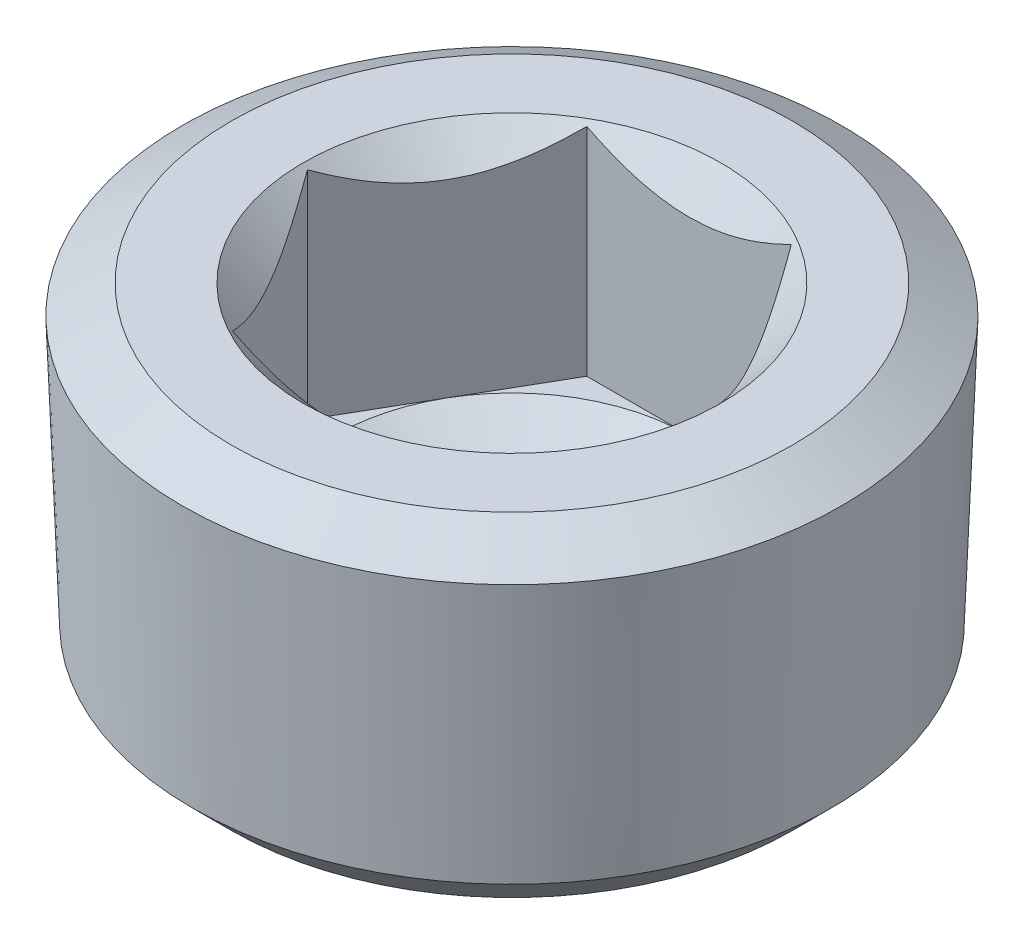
ISO-10303-21;
HEADER;
FILE_DESCRIPTION(('STEP AP214'),'2;1');
FILE_NAME('part.step','',(''),(''),'','','');
FILE_SCHEMA(('AUTOMOTIVE_DESIGN { 1 0 10303 214 1 1 1 1 }'));
ENDSEC;
DATA;
#1=APPLICATION_CONTEXT('core data for automotive mechanical design processes');
#2=APPLICATION_PROTOCOL_DEFINITION('international standard','automotive_design',2000,#1);
#3=PRODUCT_CONTEXT('',#1,'mechanical');
#4=PRODUCT('Part','Part','',(#3));
#5=PRODUCT_RELATED_PRODUCT_CATEGORY('part','',(#4));
#6=PRODUCT_DEFINITION_FORMATION('','',#4);
#7=PRODUCT_DEFINITION_CONTEXT('part definition',#1,'design');
#8=PRODUCT_DEFINITION('design','',#6,#7);
#9=PRODUCT_DEFINITION_SHAPE('','',#8);
#10=(LENGTH_UNIT() NAMED_UNIT(*) SI_UNIT(.MILLI.,.METRE.));
#11=(NAMED_UNIT(*) PLANE_ANGLE_UNIT() SI_UNIT($,.RADIAN.));
#12=(NAMED_UNIT(*) SI_UNIT($,.STERADIAN.) SOLID_ANGLE_UNIT());
#13=UNCERTAINTY_MEASURE_WITH_UNIT(LENGTH_MEASURE(1.E-05),#10,'distance_accuracy_value','');
#14=(GEOMETRIC_REPRESENTATION_CONTEXT(3) GLOBAL_UNCERTAINTY_ASSIGNED_CONTEXT((#13)) GLOBAL_UNIT_ASSIGNED_CONTEXT((#10,
#11,#12)) REPRESENTATION_CONTEXT('',''));
#15=CARTESIAN_POINT('',(0.,0.,0.));
#16=DIRECTION('',(0.,0.,1.));
#17=DIRECTION('',(1.,0.,0.));
#18=AXIS2_PLACEMENT_3D('',#15,#16,#17);
#19=CARTESIAN_POINT('',(0.,0.,0.));
#20=DIRECTION('',(0.,1.,0.));
#21=DIRECTION('',(0.,0.,1.));
#22=AXIS2_PLACEMENT_3D('',#19,#20,#21);
#23=PLANE('',#22);
#24=CARTESIAN_POINT('',(0.,0.,0.));
#25=DIRECTION('',(0.,1.,0.));
#26=DIRECTION('',(0.,0.,1.));
#27=AXIS2_PLACEMENT_3D('',#24,#25,#26);
#28=CIRCLE('',#27,8.41375);
#29=CARTESIAN_POINT('',(0.,0.,8.41375));
#30=VERTEX_POINT('',#29);
#31=EDGE_CURVE('E238',#30,#30,#28,.T.);
#32=ORIENTED_EDGE('',*,*,#31,.F.);
#33=EDGE_LOOP('',(#32));
#34=FACE_BOUND('',#33,.T.);
#35=CARTESIAN_POINT('',(0.,0.,0.));
#36=DIRECTION('',(0.,1.,0.));
#37=DIRECTION('',(0.,0.,1.));
#38=AXIS2_PLACEMENT_3D('',#35,#36,#37);
#39=CIRCLE('',#38,11.3201941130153);
#40=CARTESIAN_POINT('',(0.,0.,11.3201941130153));
#41=VERTEX_POINT('',#40);
#42=EDGE_CURVE('E12',#41,#41,#39,.T.);
#43=ORIENTED_EDGE('',*,*,#42,.T.);
#44=EDGE_LOOP('',(#43));
#45=FACE_BOUND('',#44,.T.);
#46=ADVANCED_FACE('F33',(#34,#45),#23,.T.);
#47=CARTESIAN_POINT('',(0.,0.,0.));
#48=DIRECTION('',(0.,-1.,0.));
#49=DIRECTION('',(0.,0.,-1.));
#50=AXIS2_PLACEMENT_3D('',#47,#48,#49);
#51=CONICAL_SURFACE('',#50,11.3201941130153,1.0471975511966);
#52=CARTESIAN_POINT('',(0.,-1.13926782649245,0.));
#53=DIRECTION('',(0.,1.,0.));
#54=DIRECTION('',(0.,0.,1.));
#55=AXIS2_PLACEMENT_3D('',#52,#53,#54);
#56=CIRCLE('',#55,13.2934638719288);
#57=CARTESIAN_POINT('',(0.,-1.13926782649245,13.2934638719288));
#58=VERTEX_POINT('',#57);
#59=EDGE_CURVE('E40',#58,#58,#56,.T.);
#60=ORIENTED_EDGE('',*,*,#59,.T.);
#61=EDGE_LOOP('',(#60));
#62=FACE_BOUND('',#61,.T.);
#63=ORIENTED_EDGE('',*,*,#42,.F.);
#64=EDGE_LOOP('',(#63));
#65=FACE_BOUND('',#64,.T.);
#66=ADVANCED_FACE('F228',(#62,#65),#51,.T.);
#67=CARTESIAN_POINT('',(0.,-1.13926782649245,0.));
#68=DIRECTION('',(0.,1.,0.));
#69=DIRECTION('',(0.,0.,1.));
#70=AXIS2_PLACEMENT_3D('',#67,#68,#69);
#71=CONICAL_SURFACE('',#70,13.2934638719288,0.0364424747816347);
#72=CARTESIAN_POINT('',(0.,-11.8803346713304,0.));
#73=DIRECTION('',(0.,1.,0.));
#74=DIRECTION('',(0.,0.,1.));
#75=AXIS2_PLACEMENT_3D('',#72,#73,#74);
#76=CIRCLE('',#75,12.9018594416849);
#77=CARTESIAN_POINT('',(0.,-11.8803346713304,12.9018594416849));
#78=VERTEX_POINT('',#77);
#79=EDGE_CURVE('E246',#78,#78,#76,.T.);
#80=ORIENTED_EDGE('',*,*,#79,.T.);
#81=EDGE_LOOP('',(#80));
#82=FACE_BOUND('',#81,.T.);
#83=ORIENTED_EDGE('',*,*,#59,.F.);
#84=EDGE_LOOP('',(#83));
#85=FACE_BOUND('',#84,.T.);
#86=ADVANCED_FACE('F233',(#82,#85),#71,.T.);
#87=CARTESIAN_POINT('',(0.,-11.8803346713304,0.));
#88=DIRECTION('',(0.,1.,0.));
#89=DIRECTION('',(0.,0.,1.));
#90=AXIS2_PLACEMENT_3D('',#87,#88,#89);
#91=CONICAL_SURFACE('',#90,12.9018594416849,0.785398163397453);
#92=CARTESIAN_POINT('',(0.,-13.462,0.));
#93=DIRECTION('',(0.,1.,0.));
#94=DIRECTION('',(0.,0.,1.));
#95=AXIS2_PLACEMENT_3D('',#92,#93,#94);
#96=CIRCLE('',#95,11.3201941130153);
#97=CARTESIAN_POINT('',(0.,-13.462,11.3201941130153));
#98=VERTEX_POINT('',#97);
#99=EDGE_CURVE('E242',#98,#98,#96,.T.);
#100=ORIENTED_EDGE('',*,*,#99,.T.);
#101=EDGE_LOOP('',(#100));
#102=FACE_BOUND('',#101,.T.);
#103=ORIENTED_EDGE('',*,*,#79,.F.);
#104=EDGE_LOOP('',(#103));
#105=FACE_BOUND('',#104,.T.);
#106=ADVANCED_FACE('F257',(#102,#105),#91,.T.);
#107=CARTESIAN_POINT('',(-11.3201941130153,-13.462,0.));
#108=DIRECTION('',(0.,-1.,0.));
#109=DIRECTION('',(0.,0.,-1.));
#110=AXIS2_PLACEMENT_3D('',#107,#108,#109);
#111=PLANE('',#110);
#112=ORIENTED_EDGE('',*,*,#99,.F.);
#113=EDGE_LOOP('',(#112));
#114=FACE_BOUND('',#113,.T.);
#115=ADVANCED_FACE('F175',(#114),#111,.T.);
#116=CARTESIAN_POINT('',(0.,0.,0.));
#117=DIRECTION('',(0.,1.,0.));
#118=DIRECTION('',(0.,0.,1.));
#119=AXIS2_PLACEMENT_3D('',#116,#117,#118);
#120=CONICAL_SURFACE('',#119,8.41375,0.785398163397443);
#121=CARTESIAN_POINT('',(-8.67407425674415,2.82336387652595,7.14375));
#122=CARTESIAN_POINT('',(-8.46476721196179,2.66183323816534,7.14375));
#123=CARTESIAN_POINT('',(-8.25433999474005,2.50173141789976,7.14375));
#124=CARTESIAN_POINT('',(-7.8307846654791,2.18504039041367,7.14375));
#125=CARTESIAN_POINT('',(-7.61765593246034,2.02845201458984,7.14375));
#126=CARTESIAN_POINT('',(-7.18668039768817,1.71832876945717,7.14375));
#127=CARTESIAN_POINT('',(-6.96880989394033,1.56482673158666,7.14375));
#128=CARTESIAN_POINT('',(-6.5294560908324,1.26310103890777,7.14375));
#129=CARTESIAN_POINT('',(-6.30797304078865,1.11487702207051,7.14375));
#130=CARTESIAN_POINT('',(-5.84635573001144,0.815561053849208,7.14375));
#131=CARTESIAN_POINT('',(-5.60594002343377,0.664900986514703,7.14375));
#132=CARTESIAN_POINT('',(-5.11945866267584,0.372839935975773,7.14375));
#133=CARTESIAN_POINT('',(-4.87339205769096,0.231440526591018,7.14375));
#134=CARTESIAN_POINT('',(-4.37552614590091,-0.0390949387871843,7.14375));
#135=CARTESIAN_POINT('',(-4.12374654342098,-0.168266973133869,7.14375));
#136=CARTESIAN_POINT('',(-3.61302840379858,-0.411453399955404,7.14375));
#137=CARTESIAN_POINT('',(-3.35409333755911,-0.525474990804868,7.14375));
#138=CARTESIAN_POINT('',(-2.85518097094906,-0.723606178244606,7.14375));
#139=CARTESIAN_POINT('',(-2.61595074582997,-0.809577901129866,7.14375));
#140=CARTESIAN_POINT('',(-2.13133843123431,-0.962377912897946,7.14375));
#141=CARTESIAN_POINT('',(-1.88595595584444,-1.02920499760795,7.14375));
#142=CARTESIAN_POINT('',(-1.39481286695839,-1.13896092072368,7.14375));
#143=CARTESIAN_POINT('',(-1.14915190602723,-1.1823281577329,7.14375));
#144=CARTESIAN_POINT('',(-0.654704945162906,-1.24424979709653,7.14375));
#145=CARTESIAN_POINT('',(-0.405919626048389,-1.26280951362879,7.14375));
#146=CARTESIAN_POINT('',(0.0809931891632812,-1.2735005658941,7.14375));
#147=CARTESIAN_POINT('',(0.319095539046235,-1.26678561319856,7.14375));
#148=CARTESIAN_POINT('',(0.793471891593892,-1.22996205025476,7.14375));
#149=CARTESIAN_POINT('',(1.02974572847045,-1.19985134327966,7.14375));
#150=CARTESIAN_POINT('',(1.50276174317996,-1.11743740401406,7.14375));
#151=CARTESIAN_POINT('',(1.73943403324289,-1.06473985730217,7.14375));
#152=CARTESIAN_POINT('',(2.20755573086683,-0.940095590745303,7.14375));
#153=CARTESIAN_POINT('',(2.43900540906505,-0.868149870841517,7.14375));
#154=CARTESIAN_POINT('',(2.90814144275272,-0.704039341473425,7.14375));
#155=CARTESIAN_POINT('',(3.1455239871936,-0.611016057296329,7.14375));
#156=CARTESIAN_POINT('',(3.61419107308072,-0.410586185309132,7.14375));
#157=CARTESIAN_POINT('',(3.84547282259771,-0.303173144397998,7.14375));
#158=CARTESIAN_POINT('',(4.30302519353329,-0.0765101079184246,7.14375));
#159=CARTESIAN_POINT('',(4.52927766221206,0.0427762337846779,7.14375));
#160=CARTESIAN_POINT('',(4.97660113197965,0.29056255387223,7.14375));
#161=CARTESIAN_POINT('',(5.19767292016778,0.41906112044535,7.14375));
#162=CARTESIAN_POINT('',(5.62451477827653,0.676952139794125,7.14375));
#163=CARTESIAN_POINT('',(5.83050164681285,0.805987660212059,7.14375));
#164=CARTESIAN_POINT('',(6.23893609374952,1.06955978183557,7.14375));
#165=CARTESIAN_POINT('',(6.44138340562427,1.20409679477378,7.14375));
#166=CARTESIAN_POINT('',(6.84157630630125,1.47659825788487,7.14375));
#167=CARTESIAN_POINT('',(7.03934657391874,1.6145265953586,7.14375));
#168=CARTESIAN_POINT('',(7.43217265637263,1.89408721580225,7.14375));
#169=CARTESIAN_POINT('',(7.62722920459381,2.03571846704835,7.14375));
#170=CARTESIAN_POINT('',(7.82114712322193,2.17886565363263,7.14375));
#171=B_SPLINE_CURVE_WITH_KNOTS('',3,(#121,#122,#123,#124,#125,#126,#127,#128,#129,#130,#131,
#132,#133,#134,#135,#136,#137,#138,#139,#140,#141,#142,#143,#144,#145,#146,#147,#148,#149,#150,
#151,#152,#153,#154,#155,#156,#157,#158,#159,#160,#161,#162,#163,#164,#165,#166,#167,#168,#169,
#170),.UNSPECIFIED.,.F.,.F.,(4,2,2,2,2,2,2,2,2,2,2,2,2,2,2,2,2,2,2,2,2,2,2,2,4),(0.,
0.793181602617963,1.58654895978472,2.38603037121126,3.18545683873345,4.03645697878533,
4.88760137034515,5.73615794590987,6.58430989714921,7.34628176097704,8.10830154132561,
8.85554086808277,9.60262009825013,10.3160198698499,11.029483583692,11.7559453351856,
12.4823693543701,13.2466600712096,14.0112946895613,14.7783465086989,15.545281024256,
16.2743746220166,17.0035228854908,17.7268271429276,18.4499319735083),.UNSPECIFIED.);
#172=CARTESIAN_POINT('',(4.12444598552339,-0.164858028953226,7.14375));
#173=VERTEX_POINT('',#172);
#174=CARTESIAN_POINT('',(-4.12444598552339,-0.164858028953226,7.14375));
#175=VERTEX_POINT('',#174);
#176=EDGE_CURVE('E47',#173,#175,#171,.F.);
#177=ORIENTED_EDGE('',*,*,#176,.T.);
#178=CARTESIAN_POINT('',(-4.12433051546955,-0.164742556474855,7.14395));
#179=CARTESIAN_POINT('',(-4.19524703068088,-0.235651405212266,7.02111899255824));
#180=CARTESIAN_POINT('',(-4.26670864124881,-0.304384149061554,6.89734385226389));
#181=CARTESIAN_POINT('',(-4.41082898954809,-0.436835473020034,6.64772008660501));
#182=CARTESIAN_POINT('',(-4.48348835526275,-0.500551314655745,6.52187037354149));
#183=CARTESIAN_POINT('',(-4.70409848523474,-0.683723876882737,6.13976241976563));
#184=CARTESIAN_POINT('',(-4.85391680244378,-0.794424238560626,5.88026948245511));
#185=CARTESIAN_POINT('',(-5.15603740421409,-0.983990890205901,5.35698125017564));
#186=CARTESIAN_POINT('',(-5.30826247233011,-1.0633347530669,5.09331969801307));
#187=CARTESIAN_POINT('',(-5.53910265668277,-1.15511604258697,4.69349277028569));
#188=CARTESIAN_POINT('',(-5.61638923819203,-1.18115844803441,4.55962848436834));
#189=CARTESIAN_POINT('',(-5.77161677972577,-1.22357578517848,4.2907664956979));
#190=CARTESIAN_POINT('',(-5.84955764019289,-1.23995216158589,4.15576896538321));
#191=CARTESIAN_POINT('',(-6.03948971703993,-1.26740960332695,3.82679695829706));
#192=CARTESIAN_POINT('',(-6.15168557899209,-1.27317058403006,3.63246802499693));
#193=CARTESIAN_POINT('',(-6.37587507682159,-1.26350037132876,3.24416042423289));
#194=CARTESIAN_POINT('',(-6.48786862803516,-1.24806174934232,3.05018190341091));
#195=CARTESIAN_POINT('',(-6.71079986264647,-1.19690237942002,2.66405367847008));
#196=CARTESIAN_POINT('',(-6.82173622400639,-1.16115895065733,2.47190626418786));
#197=CARTESIAN_POINT('',(-7.0417022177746,-1.07133320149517,2.09091398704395));
#198=CARTESIAN_POINT('',(-7.15073199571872,-1.01725228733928,1.90206887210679));
#199=CARTESIAN_POINT('',(-7.34427751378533,-0.905992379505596,1.56683820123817));
#200=CARTESIAN_POINT('',(-7.4292218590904,-0.851739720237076,1.41971027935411));
#201=CARTESIAN_POINT('',(-7.59758573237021,-0.734491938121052,1.1280954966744));
#202=CARTESIAN_POINT('',(-7.68100521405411,-0.671496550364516,0.983608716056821));
#203=CARTESIAN_POINT('',(-7.8460566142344,-0.538175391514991,0.69773130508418));
#204=CARTESIAN_POINT('',(-7.927693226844,-0.467872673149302,0.556332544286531));
#205=CARTESIAN_POINT('',(-8.08945480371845,-0.320859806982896,0.276153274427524));
#206=CARTESIAN_POINT('',(-8.16958065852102,-0.244153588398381,0.137371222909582));
#207=CARTESIAN_POINT('',(-8.24900744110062,-0.164742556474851,-0.000199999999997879));
#208=B_SPLINE_CURVE_WITH_KNOTS('',3,(#178,#179,#180,#181,#182,#183,#184,#185,#186,#187,#188,
#189,#190,#191,#192,#193,#194,#195,#196,#197,#198,#199,#200,#201,#202,#203,#204,#205,#206,#207),
.UNSPECIFIED.,.F.,.F.,(4,2,2,2,2,2,2,2,2,2,2,2,2,2,4),(0.,0.47568432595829,0.951626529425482,
1.90864918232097,2.85047554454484,3.32046508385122,3.79038435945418,4.46273505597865,
5.13532141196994,5.80866054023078,6.48194804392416,7.01672008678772,7.55150833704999,
8.08465792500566,8.61748274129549),.UNSPECIFIED.);
#209=CARTESIAN_POINT('',(-8.24889197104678,-0.164858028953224,0.));
#210=VERTEX_POINT('',#209);
#211=EDGE_CURVE('E119',#175,#210,#208,.T.);
#212=ORIENTED_EDGE('',*,*,#211,.T.);
#213=CARTESIAN_POINT('',(-8.24900744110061,-0.164742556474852,0.000200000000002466));
#214=CARTESIAN_POINT('',(-8.17809092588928,-0.235651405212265,-0.122631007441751));
#215=CARTESIAN_POINT('',(-8.10662931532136,-0.304384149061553,-0.246406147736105));
#216=CARTESIAN_POINT('',(-7.96250896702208,-0.436835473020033,-0.496029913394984));
#217=CARTESIAN_POINT('',(-7.88984960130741,-0.500551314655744,-0.621879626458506));
#218=CARTESIAN_POINT('',(-7.66923947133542,-0.683723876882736,-1.00398758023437));
#219=CARTESIAN_POINT('',(-7.51942115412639,-0.794424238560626,-1.26348051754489));
#220=CARTESIAN_POINT('',(-7.21730055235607,-0.983990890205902,-1.78676874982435));
#221=CARTESIAN_POINT('',(-7.06507548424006,-1.0633347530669,-2.05043030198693));
#222=CARTESIAN_POINT('',(-6.83423529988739,-1.15511604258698,-2.45025722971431));
#223=CARTESIAN_POINT('',(-6.75694871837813,-1.18115844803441,-2.58412151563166));
#224=CARTESIAN_POINT('',(-6.60172117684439,-1.22357578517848,-2.8529835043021));
#225=CARTESIAN_POINT('',(-6.52378031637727,-1.23995216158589,-2.9879810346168));
#226=CARTESIAN_POINT('',(-6.33384823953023,-1.26740960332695,-3.31695304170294));
#227=CARTESIAN_POINT('',(-6.22165237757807,-1.27317058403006,-3.51128197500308));
#228=CARTESIAN_POINT('',(-5.99746287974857,-1.26350037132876,-3.89958957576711));
#229=CARTESIAN_POINT('',(-5.885469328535,-1.24806174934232,-4.09356809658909));
#230=CARTESIAN_POINT('',(-5.6625380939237,-1.19690237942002,-4.47969632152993));
#231=CARTESIAN_POINT('',(-5.55160173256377,-1.16115895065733,-4.67184373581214));
#232=CARTESIAN_POINT('',(-5.33163573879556,-1.07133320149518,-5.05283601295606));
#233=CARTESIAN_POINT('',(-5.22260596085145,-1.01725228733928,-5.24168112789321));
#234=CARTESIAN_POINT('',(-5.02906044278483,-0.905992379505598,-5.57691179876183));
#235=CARTESIAN_POINT('',(-4.94411609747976,-0.851739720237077,-5.72403972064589));
#236=CARTESIAN_POINT('',(-4.77575222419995,-0.734491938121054,-6.01565450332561));
#237=CARTESIAN_POINT('',(-4.69233274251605,-0.671496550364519,-6.16014128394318));
#238=CARTESIAN_POINT('',(-4.52728134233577,-0.538175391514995,-6.44601869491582));
#239=CARTESIAN_POINT('',(-4.44564472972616,-0.467872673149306,-6.58741745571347));
#240=CARTESIAN_POINT('',(-4.28388315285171,-0.320859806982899,-6.86759672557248));
#241=CARTESIAN_POINT('',(-4.20375729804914,-0.244153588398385,-7.00637877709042));
#242=CARTESIAN_POINT('',(-4.12433051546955,-0.164742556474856,-7.14395));
#243=B_SPLINE_CURVE_WITH_KNOTS('',3,(#213,#214,#215,#216,#217,#218,#219,#220,#221,#222,#223,
#224,#225,#226,#227,#228,#229,#230,#231,#232,#233,#234,#235,#236,#237,#238,#239,#240,#241,#242),
.UNSPECIFIED.,.F.,.F.,(4,2,2,2,2,2,2,2,2,2,2,2,2,2,4),(0.,0.475684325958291,0.951626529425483,
1.90864918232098,2.85047554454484,3.32046508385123,3.79038435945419,4.46273505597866,
5.13532141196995,5.80866054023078,6.48194804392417,7.01672008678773,7.55150833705,
8.08465792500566,8.61748274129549),.UNSPECIFIED.);
#244=CARTESIAN_POINT('',(-4.12444598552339,-0.164858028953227,-7.14375));
#245=VERTEX_POINT('',#244);
#246=EDGE_CURVE('E197',#210,#245,#243,.T.);
#247=ORIENTED_EDGE('',*,*,#246,.T.);
#248=CARTESIAN_POINT('',(-8.67407425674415,2.82336387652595,-7.14375));
#249=CARTESIAN_POINT('',(-8.46476721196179,2.66183323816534,-7.14375));
#250=CARTESIAN_POINT('',(-8.25433999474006,2.50173141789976,-7.14375));
#251=CARTESIAN_POINT('',(-7.83078466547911,2.18504039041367,-7.14375));
#252=CARTESIAN_POINT('',(-7.61765593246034,2.02845201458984,-7.14375));
#253=CARTESIAN_POINT('',(-7.18668039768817,1.71832876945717,-7.14375));
#254=CARTESIAN_POINT('',(-6.96880989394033,1.56482673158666,-7.14375));
#255=CARTESIAN_POINT('',(-6.52945609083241,1.26310103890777,-7.14375));
#256=CARTESIAN_POINT('',(-6.30797304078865,1.11487702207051,-7.14375));
#257=CARTESIAN_POINT('',(-5.84635573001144,0.815561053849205,-7.14375));
#258=CARTESIAN_POINT('',(-5.60594002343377,0.6649009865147,-7.14375));
#259=CARTESIAN_POINT('',(-5.11945866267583,0.372839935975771,-7.14375));
#260=CARTESIAN_POINT('',(-4.87339205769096,0.231440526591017,-7.14375));
#261=CARTESIAN_POINT('',(-4.37552614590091,-0.0390949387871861,-7.14375));
#262=CARTESIAN_POINT('',(-4.12374654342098,-0.168266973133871,-7.14375));
#263=CARTESIAN_POINT('',(-3.61302840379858,-0.411453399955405,-7.14375));
#264=CARTESIAN_POINT('',(-3.35409333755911,-0.52547499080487,-7.14375));
#265=CARTESIAN_POINT('',(-2.85518097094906,-0.723606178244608,-7.14375));
#266=CARTESIAN_POINT('',(-2.61595074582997,-0.809577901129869,-7.14375));
#267=CARTESIAN_POINT('',(-2.13133843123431,-0.962377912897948,-7.14375));
#268=CARTESIAN_POINT('',(-1.88595595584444,-1.02920499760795,-7.14375));
#269=CARTESIAN_POINT('',(-1.39481286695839,-1.13896092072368,-7.14375));
#270=CARTESIAN_POINT('',(-1.14915190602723,-1.18232815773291,-7.14375));
#271=CARTESIAN_POINT('',(-0.654704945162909,-1.24424979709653,-7.14375));
#272=CARTESIAN_POINT('',(-0.405919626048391,-1.26280951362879,-7.14375));
#273=CARTESIAN_POINT('',(0.0809931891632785,-1.2735005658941,-7.14375));
#274=CARTESIAN_POINT('',(0.319095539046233,-1.26678561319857,-7.14375));
#275=CARTESIAN_POINT('',(0.793471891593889,-1.22996205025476,-7.14375));
#276=CARTESIAN_POINT('',(1.02974572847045,-1.19985134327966,-7.14375));
#277=CARTESIAN_POINT('',(1.50276174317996,-1.11743740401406,-7.14375));
#278=CARTESIAN_POINT('',(1.73943403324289,-1.06473985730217,-7.14375));
#279=CARTESIAN_POINT('',(2.20755573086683,-0.940095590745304,-7.14375));
#280=CARTESIAN_POINT('',(2.43900540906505,-0.868149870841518,-7.14375));
#281=CARTESIAN_POINT('',(2.90814144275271,-0.704039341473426,-7.14375));
#282=CARTESIAN_POINT('',(3.1455239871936,-0.611016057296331,-7.14375));
#283=CARTESIAN_POINT('',(3.61419107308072,-0.410586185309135,-7.14375));
#284=CARTESIAN_POINT('',(3.8454728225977,-0.303173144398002,-7.14375));
#285=CARTESIAN_POINT('',(4.30302519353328,-0.0765101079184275,-7.14375));
#286=CARTESIAN_POINT('',(4.52927766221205,0.0427762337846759,-7.14375));
#287=CARTESIAN_POINT('',(4.97660113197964,0.290562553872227,-7.14375));
#288=CARTESIAN_POINT('',(5.19767292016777,0.419061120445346,-7.14375));
#289=CARTESIAN_POINT('',(5.62451477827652,0.676952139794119,-7.14375));
#290=CARTESIAN_POINT('',(5.83050164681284,0.805987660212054,-7.14375));
#291=CARTESIAN_POINT('',(6.23893609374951,1.06955978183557,-7.14375));
#292=CARTESIAN_POINT('',(6.44138340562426,1.20409679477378,-7.14375));
#293=CARTESIAN_POINT('',(6.84157630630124,1.47659825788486,-7.14375));
#294=CARTESIAN_POINT('',(7.03934657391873,1.61452659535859,-7.14375));
#295=CARTESIAN_POINT('',(7.43217265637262,1.89408721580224,-7.14375));
#296=CARTESIAN_POINT('',(7.6272292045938,2.03571846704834,-7.14375));
#297=CARTESIAN_POINT('',(7.82114712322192,2.17886565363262,-7.14375));
#298=B_SPLINE_CURVE_WITH_KNOTS('',3,(#248,#249,#250,#251,#252,#253,#254,#255,#256,#257,#258,
#259,#260,#261,#262,#263,#264,#265,#266,#267,#268,#269,#270,#271,#272,#273,#274,#275,#276,#277,
#278,#279,#280,#281,#282,#283,#284,#285,#286,#287,#288,#289,#290,#291,#292,#293,#294,#295,#296,
#297),.UNSPECIFIED.,.F.,.F.,(4,2,2,2,2,2,2,2,2,2,2,2,2,2,2,2,2,2,2,2,2,2,2,2,4),(0.,
0.79318160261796,1.58654895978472,2.38603037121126,3.18545683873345,4.03645697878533,
4.88760137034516,5.73615794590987,6.58430989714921,7.34628176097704,8.10830154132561,
8.85554086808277,9.60262009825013,10.3160198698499,11.029483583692,11.7559453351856,
12.4823693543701,13.2466600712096,14.0112946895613,14.7783465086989,15.545281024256,
16.2743746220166,17.0035228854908,17.7268271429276,18.4499319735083),.UNSPECIFIED.);
#299=CARTESIAN_POINT('',(4.12444598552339,-0.164858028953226,-7.14375));
#300=VERTEX_POINT('',#299);
#301=EDGE_CURVE('E191',#245,#300,#298,.T.);
#302=ORIENTED_EDGE('',*,*,#301,.T.);
#303=CARTESIAN_POINT('',(4.12433051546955,-0.164742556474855,-7.14395));
#304=CARTESIAN_POINT('',(4.19524703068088,-0.235651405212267,-7.02111899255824));
#305=CARTESIAN_POINT('',(4.26670864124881,-0.304384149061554,-6.89734385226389));
#306=CARTESIAN_POINT('',(4.41082898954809,-0.436835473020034,-6.64772008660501));
#307=CARTESIAN_POINT('',(4.48348835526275,-0.500551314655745,-6.52187037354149));
#308=CARTESIAN_POINT('',(4.70409848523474,-0.683723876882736,-6.13976241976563));
#309=CARTESIAN_POINT('',(4.85391680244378,-0.794424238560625,-5.88026948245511));
#310=CARTESIAN_POINT('',(5.15603740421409,-0.983990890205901,-5.35698125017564));
#311=CARTESIAN_POINT('',(5.30826247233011,-1.0633347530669,-5.09331969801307));
#312=CARTESIAN_POINT('',(5.53910265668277,-1.15511604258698,-4.69349277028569));
#313=CARTESIAN_POINT('',(5.61638923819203,-1.18115844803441,-4.55962848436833));
#314=CARTESIAN_POINT('',(5.77161677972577,-1.22357578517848,-4.2907664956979));
#315=CARTESIAN_POINT('',(5.84955764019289,-1.23995216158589,-4.1557689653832));
#316=CARTESIAN_POINT('',(6.03948971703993,-1.26740960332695,-3.82679695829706));
#317=CARTESIAN_POINT('',(6.15168557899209,-1.27317058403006,-3.63246802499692));
#318=CARTESIAN_POINT('',(6.37587507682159,-1.26350037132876,-3.24416042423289));
#319=CARTESIAN_POINT('',(6.48786862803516,-1.24806174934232,-3.05018190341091));
#320=CARTESIAN_POINT('',(6.71079986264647,-1.19690237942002,-2.66405367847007));
#321=CARTESIAN_POINT('',(6.82173622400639,-1.16115895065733,-2.47190626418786));
#322=CARTESIAN_POINT('',(7.0417022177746,-1.07133320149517,-2.09091398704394));
#323=CARTESIAN_POINT('',(7.15073199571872,-1.01725228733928,-1.90206887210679));
#324=CARTESIAN_POINT('',(7.34427751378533,-0.905992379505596,-1.56683820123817));
#325=CARTESIAN_POINT('',(7.4292218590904,-0.851739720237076,-1.41971027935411));
#326=CARTESIAN_POINT('',(7.59758573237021,-0.734491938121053,-1.12809549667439));
#327=CARTESIAN_POINT('',(7.68100521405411,-0.671496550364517,-0.98360871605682));
#328=CARTESIAN_POINT('',(7.8460566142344,-0.538175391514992,-0.697731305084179));
#329=CARTESIAN_POINT('',(7.927693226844,-0.467872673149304,-0.55633254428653));
#330=CARTESIAN_POINT('',(8.08945480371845,-0.320859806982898,-0.276153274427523));
#331=CARTESIAN_POINT('',(8.16958065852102,-0.244153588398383,-0.137371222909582));
#332=CARTESIAN_POINT('',(8.24900744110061,-0.164742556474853,0.000199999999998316));
#333=B_SPLINE_CURVE_WITH_KNOTS('',3,(#303,#304,#305,#306,#307,#308,#309,#310,#311,#312,#313,
#314,#315,#316,#317,#318,#319,#320,#321,#322,#323,#324,#325,#326,#327,#328,#329,#330,#331,#332),
.UNSPECIFIED.,.F.,.F.,(4,2,2,2,2,2,2,2,2,2,2,2,2,2,4),(0.,0.47568432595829,0.951626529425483,
1.90864918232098,2.85047554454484,3.32046508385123,3.79038435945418,4.46273505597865,
5.13532141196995,5.80866054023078,6.48194804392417,7.01672008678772,7.55150833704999,
8.08465792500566,8.61748274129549),.UNSPECIFIED.);
#334=CARTESIAN_POINT('',(8.24889197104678,-0.164858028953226,0.));
#335=VERTEX_POINT('',#334);
#336=EDGE_CURVE('E185',#300,#335,#333,.T.);
#337=ORIENTED_EDGE('',*,*,#336,.T.);
#338=CARTESIAN_POINT('',(8.24900744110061,-0.164742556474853,-0.000200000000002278));
#339=CARTESIAN_POINT('',(8.17809092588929,-0.235651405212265,0.122631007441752));
#340=CARTESIAN_POINT('',(8.10662931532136,-0.304384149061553,0.246406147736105));
#341=CARTESIAN_POINT('',(7.96250896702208,-0.436835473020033,0.496029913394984));
#342=CARTESIAN_POINT('',(7.88984960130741,-0.500551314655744,0.621879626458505));
#343=CARTESIAN_POINT('',(7.66923947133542,-0.683723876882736,1.00398758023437));
#344=CARTESIAN_POINT('',(7.51942115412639,-0.794424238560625,1.26348051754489));
#345=CARTESIAN_POINT('',(7.21730055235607,-0.983990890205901,1.78676874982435));
#346=CARTESIAN_POINT('',(7.06507548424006,-1.0633347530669,2.05043030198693));
#347=CARTESIAN_POINT('',(6.8342352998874,-1.15511604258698,2.45025722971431));
#348=CARTESIAN_POINT('',(6.75694871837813,-1.18115844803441,2.58412151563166));
#349=CARTESIAN_POINT('',(6.6017211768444,-1.22357578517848,2.8529835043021));
#350=CARTESIAN_POINT('',(6.52378031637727,-1.23995216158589,2.98798103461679));
#351=CARTESIAN_POINT('',(6.33384823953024,-1.26740960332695,3.31695304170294));
#352=CARTESIAN_POINT('',(6.22165237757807,-1.27317058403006,3.51128197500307));
#353=CARTESIAN_POINT('',(5.99746287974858,-1.26350037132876,3.89958957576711));
#354=CARTESIAN_POINT('',(5.885469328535,-1.24806174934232,4.09356809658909));
#355=CARTESIAN_POINT('',(5.6625380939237,-1.19690237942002,4.47969632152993));
#356=CARTESIAN_POINT('',(5.55160173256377,-1.16115895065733,4.67184373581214));
#357=CARTESIAN_POINT('',(5.33163573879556,-1.07133320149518,5.05283601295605));
#358=CARTESIAN_POINT('',(5.22260596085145,-1.01725228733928,5.24168112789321));
#359=CARTESIAN_POINT('',(5.02906044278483,-0.905992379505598,5.57691179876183));
#360=CARTESIAN_POINT('',(4.94411609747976,-0.851739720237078,5.72403972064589));
#361=CARTESIAN_POINT('',(4.77575222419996,-0.734491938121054,6.0156545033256));
#362=CARTESIAN_POINT('',(4.69233274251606,-0.671496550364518,6.16014128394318));
#363=CARTESIAN_POINT('',(4.52728134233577,-0.538175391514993,6.44601869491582));
#364=CARTESIAN_POINT('',(4.44564472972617,-0.467872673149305,6.58741745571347));
#365=CARTESIAN_POINT('',(4.28388315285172,-0.320859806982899,6.86759672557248));
#366=CARTESIAN_POINT('',(4.20375729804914,-0.244153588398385,7.00637877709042));
#367=CARTESIAN_POINT('',(4.12433051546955,-0.164742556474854,7.14395));
#368=B_SPLINE_CURVE_WITH_KNOTS('',3,(#338,#339,#340,#341,#342,#343,#344,#345,#346,#347,#348,
#349,#350,#351,#352,#353,#354,#355,#356,#357,#358,#359,#360,#361,#362,#363,#364,#365,#366,#367),
.UNSPECIFIED.,.F.,.F.,(4,2,2,2,2,2,2,2,2,2,2,2,2,2,4),(0.,0.47568432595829,0.951626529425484,
1.90864918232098,2.85047554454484,3.32046508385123,3.79038435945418,4.46273505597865,
5.13532141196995,5.80866054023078,6.48194804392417,7.01672008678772,7.55150833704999,
8.08465792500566,8.61748274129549),.UNSPECIFIED.);
#369=EDGE_CURVE('E162',#335,#173,#368,.T.);
#370=ORIENTED_EDGE('',*,*,#369,.T.);
#371=EDGE_LOOP('',(#177,#212,#247,#302,#337,#370));
#372=FACE_BOUND('',#371,.T.);
#373=ORIENTED_EDGE('',*,*,#31,.T.);
#374=EDGE_LOOP('',(#373));
#375=FACE_BOUND('',#374,.T.);
#376=ADVANCED_FACE('F170',(#372,#375),#120,.F.);
#377=CARTESIAN_POINT('',(-8.24889197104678,-8.89,0.));
#378=DIRECTION('',(-0.866025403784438,0.,0.5));
#379=DIRECTION('',(0.5,0.,0.866025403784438));
#380=AXIS2_PLACEMENT_3D('',#377,#378,#379);
#381=PLANE('',#380);
#382=DIRECTION('',(0.,1.,0.));
#383=VECTOR('',#382,1.);
#384=CARTESIAN_POINT('',(-4.12444598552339,-8.89,7.14375));
#385=LINE('',#384,#383);
#386=CARTESIAN_POINT('',(-4.12444598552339,-8.89,7.14375));
#387=VERTEX_POINT('',#386);
#388=EDGE_CURVE('E116',#387,#175,#385,.T.);
#389=ORIENTED_EDGE('',*,*,#388,.F.);
#390=DIRECTION('',(0.5,0.,0.866025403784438));
#391=VECTOR('',#390,1.);
#392=CARTESIAN_POINT('',(-8.24889197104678,-8.89,0.));
#393=LINE('',#392,#391);
#394=CARTESIAN_POINT('',(-6.18666897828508,-8.89,3.571875));
#395=VERTEX_POINT('',#394);
#396=EDGE_CURVE('E103',#395,#387,#393,.T.);
#397=ORIENTED_EDGE('',*,*,#396,.F.);
#398=CARTESIAN_POINT('',(-8.24889197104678,-8.89,0.));
#399=VERTEX_POINT('',#398);
#400=EDGE_CURVE('E113',#399,#395,#393,.T.);
#401=ORIENTED_EDGE('',*,*,#400,.F.);
#402=DIRECTION('',(0.,1.,0.));
#403=VECTOR('',#402,1.);
#404=CARTESIAN_POINT('',(-8.24889197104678,-8.89,0.));
#405=LINE('',#404,#403);
#406=EDGE_CURVE('E143',#399,#210,#405,.T.);
#407=ORIENTED_EDGE('',*,*,#406,.T.);
#408=ORIENTED_EDGE('',*,*,#211,.F.);
#409=EDGE_LOOP('',(#389,#397,#401,#407,#408));
#410=FACE_BOUND('',#409,.T.);
#411=ADVANCED_FACE('F117',(#410),#381,.F.);
#412=CARTESIAN_POINT('',(-4.12444598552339,-8.89,-7.14375));
#413=DIRECTION('',(-0.866025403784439,0.,-0.5));
#414=DIRECTION('',(-0.5,0.,0.866025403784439));
#415=AXIS2_PLACEMENT_3D('',#412,#413,#414);
#416=PLANE('',#415);
#417=ORIENTED_EDGE('',*,*,#406,.F.);
#418=DIRECTION('',(-0.5,0.,0.866025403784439));
#419=VECTOR('',#418,1.);
#420=CARTESIAN_POINT('',(-4.12444598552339,-8.89,-7.14375));
#421=LINE('',#420,#419);
#422=CARTESIAN_POINT('',(-6.18666897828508,-8.89,-3.571875));
#423=VERTEX_POINT('',#422);
#424=EDGE_CURVE('E140',#423,#399,#421,.T.);
#425=ORIENTED_EDGE('',*,*,#424,.F.);
#426=CARTESIAN_POINT('',(-4.12444598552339,-8.89,-7.14375));
#427=VERTEX_POINT('',#426);
#428=EDGE_CURVE('E122',#427,#423,#421,.T.);
#429=ORIENTED_EDGE('',*,*,#428,.F.);
#430=DIRECTION('',(0.,1.,0.));
#431=VECTOR('',#430,1.);
#432=CARTESIAN_POINT('',(-4.12444598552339,-8.89,-7.14375));
#433=LINE('',#432,#431);
#434=EDGE_CURVE('E145',#427,#245,#433,.T.);
#435=ORIENTED_EDGE('',*,*,#434,.T.);
#436=ORIENTED_EDGE('',*,*,#246,.F.);
#437=EDGE_LOOP('',(#417,#425,#429,#435,#436));
#438=FACE_BOUND('',#437,.T.);
#439=ADVANCED_FACE('F206',(#438),#416,.F.);
#440=CARTESIAN_POINT('',(4.12444598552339,-8.89,-7.14375));
#441=DIRECTION('',(0.,0.,-1.));
#442=DIRECTION('',(-1.,0.,0.));
#443=AXIS2_PLACEMENT_3D('',#440,#441,#442);
#444=PLANE('',#443);
#445=ORIENTED_EDGE('',*,*,#434,.F.);
#446=DIRECTION('',(-1.,0.,0.));
#447=VECTOR('',#446,1.);
#448=CARTESIAN_POINT('',(4.12444598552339,-8.89,-7.14375));
#449=LINE('',#448,#447);
#450=CARTESIAN_POINT('',(0.,-8.89,-7.14375));
#451=VERTEX_POINT('',#450);
#452=EDGE_CURVE('E136',#451,#427,#449,.T.);
#453=ORIENTED_EDGE('',*,*,#452,.F.);
#454=CARTESIAN_POINT('',(4.12444598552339,-8.89,-7.14375));
#455=VERTEX_POINT('',#454);
#456=EDGE_CURVE('E137',#455,#451,#449,.T.);
#457=ORIENTED_EDGE('',*,*,#456,.F.);
#458=DIRECTION('',(0.,1.,0.));
#459=VECTOR('',#458,1.);
#460=CARTESIAN_POINT('',(4.12444598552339,-8.89,-7.14375));
#461=LINE('',#460,#459);
#462=EDGE_CURVE('E148',#455,#300,#461,.T.);
#463=ORIENTED_EDGE('',*,*,#462,.T.);
#464=ORIENTED_EDGE('',*,*,#301,.F.);
#465=EDGE_LOOP('',(#445,#453,#457,#463,#464));
#466=FACE_BOUND('',#465,.T.);
#467=ADVANCED_FACE('F210',(#466),#444,.F.);
#468=CARTESIAN_POINT('',(8.24889197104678,-8.89,0.));
#469=DIRECTION('',(0.866025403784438,0.,-0.5));
#470=DIRECTION('',(-0.5,0.,-0.866025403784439));
#471=AXIS2_PLACEMENT_3D('',#468,#469,#470);
#472=PLANE('',#471);
#473=ORIENTED_EDGE('',*,*,#462,.F.);
#474=DIRECTION('',(-0.5,0.,-0.866025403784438));
#475=VECTOR('',#474,1.);
#476=CARTESIAN_POINT('',(8.24889197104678,-8.89,0.));
#477=LINE('',#476,#475);
#478=CARTESIAN_POINT('',(6.18666897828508,-8.89,-3.571875));
#479=VERTEX_POINT('',#478);
#480=EDGE_CURVE('E132',#479,#455,#477,.T.);
#481=ORIENTED_EDGE('',*,*,#480,.F.);
#482=CARTESIAN_POINT('',(8.24889197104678,-8.89,0.));
#483=VERTEX_POINT('',#482);
#484=EDGE_CURVE('E133',#483,#479,#477,.T.);
#485=ORIENTED_EDGE('',*,*,#484,.F.);
#486=DIRECTION('',(0.,1.,0.));
#487=VECTOR('',#486,1.);
#488=CARTESIAN_POINT('',(8.24889197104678,-8.89,0.));
#489=LINE('',#488,#487);
#490=EDGE_CURVE('E151',#483,#335,#489,.T.);
#491=ORIENTED_EDGE('',*,*,#490,.T.);
#492=ORIENTED_EDGE('',*,*,#336,.F.);
#493=EDGE_LOOP('',(#473,#481,#485,#491,#492));
#494=FACE_BOUND('',#493,.T.);
#495=ADVANCED_FACE('F214',(#494),#472,.F.);
#496=CARTESIAN_POINT('',(4.12444598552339,-8.89,7.14375));
#497=DIRECTION('',(0.866025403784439,0.,0.5));
#498=DIRECTION('',(0.5,0.,-0.866025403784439));
#499=AXIS2_PLACEMENT_3D('',#496,#497,#498);
#500=PLANE('',#499);
#501=ORIENTED_EDGE('',*,*,#490,.F.);
#502=DIRECTION('',(0.5,0.,-0.866025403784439));
#503=VECTOR('',#502,1.);
#504=CARTESIAN_POINT('',(4.12444598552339,-8.89,7.14375));
#505=LINE('',#504,#503);
#506=CARTESIAN_POINT('',(6.18666897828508,-8.89,3.571875));
#507=VERTEX_POINT('',#506);
#508=EDGE_CURVE('E128',#507,#483,#505,.T.);
#509=ORIENTED_EDGE('',*,*,#508,.F.);
#510=CARTESIAN_POINT('',(4.12444598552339,-8.89,7.14375));
#511=VERTEX_POINT('',#510);
#512=EDGE_CURVE('E55',#511,#507,#505,.T.);
#513=ORIENTED_EDGE('',*,*,#512,.F.);
#514=DIRECTION('',(0.,1.,0.));
#515=VECTOR('',#514,1.);
#516=CARTESIAN_POINT('',(4.12444598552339,-8.89,7.14375));
#517=LINE('',#516,#515);
#518=EDGE_CURVE('E121',#511,#173,#517,.T.);
#519=ORIENTED_EDGE('',*,*,#518,.T.);
#520=ORIENTED_EDGE('',*,*,#369,.F.);
#521=EDGE_LOOP('',(#501,#509,#513,#519,#520));
#522=FACE_BOUND('',#521,.T.);
#523=ADVANCED_FACE('F218',(#522),#500,.F.);
#524=CARTESIAN_POINT('',(-4.12444598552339,-8.89,7.14375));
#525=DIRECTION('',(0.,0.,1.));
#526=DIRECTION('',(1.,0.,0.));
#527=AXIS2_PLACEMENT_3D('',#524,#525,#526);
#528=PLANE('',#527);
#529=ORIENTED_EDGE('',*,*,#518,.F.);
#530=DIRECTION('',(1.,0.,0.));
#531=VECTOR('',#530,1.);
#532=CARTESIAN_POINT('',(-4.12444598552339,-8.89,7.14375));
#533=LINE('',#532,#531);
#534=CARTESIAN_POINT('',(0.,-8.89,7.14375));
#535=VERTEX_POINT('',#534);
#536=EDGE_CURVE('E127',#535,#511,#533,.T.);
#537=ORIENTED_EDGE('',*,*,#536,.F.);
#538=EDGE_CURVE('E107',#387,#535,#533,.T.);
#539=ORIENTED_EDGE('',*,*,#538,.F.);
#540=ORIENTED_EDGE('',*,*,#388,.T.);
#541=ORIENTED_EDGE('',*,*,#176,.F.);
#542=EDGE_LOOP('',(#529,#537,#539,#540,#541));
#543=FACE_BOUND('',#542,.T.);
#544=ADVANCED_FACE('F126',(#543),#528,.F.);
#545=CARTESIAN_POINT('',(0.,-8.89,0.));
#546=DIRECTION('',(0.,1.,0.));
#547=DIRECTION('',(0.,0.,1.));
#548=AXIS2_PLACEMENT_3D('',#545,#546,#547);
#549=PLANE('',#548);
#550=CARTESIAN_POINT('',(0.,-8.89,0.));
#551=DIRECTION('',(0.,1.,0.));
#552=DIRECTION('',(0.,0.,1.));
#553=AXIS2_PLACEMENT_3D('',#550,#551,#552);
#554=CIRCLE('',#553,7.14375);
#555=EDGE_CURVE('E109',#395,#535,#554,.T.);
#556=ORIENTED_EDGE('',*,*,#555,.F.);
#557=ORIENTED_EDGE('',*,*,#396,.T.);
#558=ORIENTED_EDGE('',*,*,#538,.T.);
#559=EDGE_LOOP('',(#556,#557,#558));
#560=FACE_BOUND('',#559,.T.);
#561=ADVANCED_FACE('F105',(#560),#549,.T.);
#562=EDGE_CURVE('E408',#423,#395,#554,.T.);
#563=ORIENTED_EDGE('',*,*,#562,.F.);
#564=ORIENTED_EDGE('',*,*,#424,.T.);
#565=ORIENTED_EDGE('',*,*,#400,.T.);
#566=EDGE_LOOP('',(#563,#564,#565));
#567=FACE_BOUND('',#566,.T.);
#568=ADVANCED_FACE('F314',(#567),#549,.T.);
#569=EDGE_CURVE('E419',#451,#423,#554,.T.);
#570=ORIENTED_EDGE('',*,*,#569,.F.);
#571=ORIENTED_EDGE('',*,*,#452,.T.);
#572=ORIENTED_EDGE('',*,*,#428,.T.);
#573=EDGE_LOOP('',(#570,#571,#572));
#574=FACE_BOUND('',#573,.T.);
#575=ADVANCED_FACE('F323',(#574),#549,.T.);
#576=EDGE_CURVE('E420',#479,#451,#554,.T.);
#577=ORIENTED_EDGE('',*,*,#576,.F.);
#578=ORIENTED_EDGE('',*,*,#480,.T.);
#579=ORIENTED_EDGE('',*,*,#456,.T.);
#580=EDGE_LOOP('',(#577,#578,#579));
#581=FACE_BOUND('',#580,.T.);
#582=ADVANCED_FACE('F332',(#581),#549,.T.);
#583=EDGE_CURVE('E249',#507,#479,#554,.T.);
#584=ORIENTED_EDGE('',*,*,#583,.F.);
#585=ORIENTED_EDGE('',*,*,#508,.T.);
#586=ORIENTED_EDGE('',*,*,#484,.T.);
#587=EDGE_LOOP('',(#584,#585,#586));
#588=FACE_BOUND('',#587,.T.);
#589=ADVANCED_FACE('F341',(#588),#549,.T.);
#590=EDGE_CURVE('E243',#535,#507,#554,.T.);
#591=ORIENTED_EDGE('',*,*,#590,.F.);
#592=ORIENTED_EDGE('',*,*,#536,.T.);
#593=ORIENTED_EDGE('',*,*,#512,.T.);
#594=EDGE_LOOP('',(#591,#592,#593));
#595=FACE_BOUND('',#594,.T.);
#596=ADVANCED_FACE('F315',(#595),#549,.T.);
#597=CARTESIAN_POINT('',(-5.03011505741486,-10.16,0.));
#598=DIRECTION('',(0.,-1.,0.));
#599=DIRECTION('',(0.,0.,-1.));
#600=AXIS2_PLACEMENT_3D('',#597,#598,#599);
#601=PLANE('',#600);
#602=CARTESIAN_POINT('',(0.,-10.16,0.));
#603=DIRECTION('',(0.,1.,0.));
#604=DIRECTION('',(0.,0.,1.));
#605=AXIS2_PLACEMENT_3D('',#602,#603,#604);
#606=CIRCLE('',#605,5.03011505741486);
#607=CARTESIAN_POINT('',(0.,-10.16,5.03011505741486));
#608=VERTEX_POINT('',#607);
#609=EDGE_CURVE('E407',#608,#608,#606,.T.);
#610=ORIENTED_EDGE('',*,*,#609,.T.);
#611=EDGE_LOOP('',(#610));
#612=FACE_BOUND('',#611,.T.);
#613=ADVANCED_FACE('F358',(#612),#601,.F.);
#614=CARTESIAN_POINT('',(0.,-8.89,0.));
#615=DIRECTION('',(0.,1.,0.));
#616=DIRECTION('',(0.,0.,1.));
#617=AXIS2_PLACEMENT_3D('',#614,#615,#616);
#618=CONICAL_SURFACE('',#617,7.14375,1.02974425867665);
#619=ORIENTED_EDGE('',*,*,#609,.F.);
#620=EDGE_LOOP('',(#619));
#621=FACE_BOUND('',#620,.T.);
#622=ORIENTED_EDGE('',*,*,#590,.T.);
#623=ORIENTED_EDGE('',*,*,#583,.T.);
#624=ORIENTED_EDGE('',*,*,#576,.T.);
#625=ORIENTED_EDGE('',*,*,#569,.T.);
#626=ORIENTED_EDGE('',*,*,#562,.T.);
#627=ORIENTED_EDGE('',*,*,#555,.T.);
#628=EDGE_LOOP('',(#622,#623,#624,#625,#626,#627));
#629=FACE_BOUND('',#628,.T.);
#630=ADVANCED_FACE('F176',(#621,#629),#618,.F.);
#631=CLOSED_SHELL('',(#46,#66,#86,#106,#115,#376,#411,#439,#467,#495,#523,#544,#561,#568,#575,
#582,#589,#596,#613,#630));
#632=MANIFOLD_SOLID_BREP('B2',#631);
#633=ADVANCED_BREP_SHAPE_REPRESENTATION('',(#18,#632),#14);
#634=SHAPE_DEFINITION_REPRESENTATION(#9,#633);
ENDSEC;
END-ISO-10303-21;
